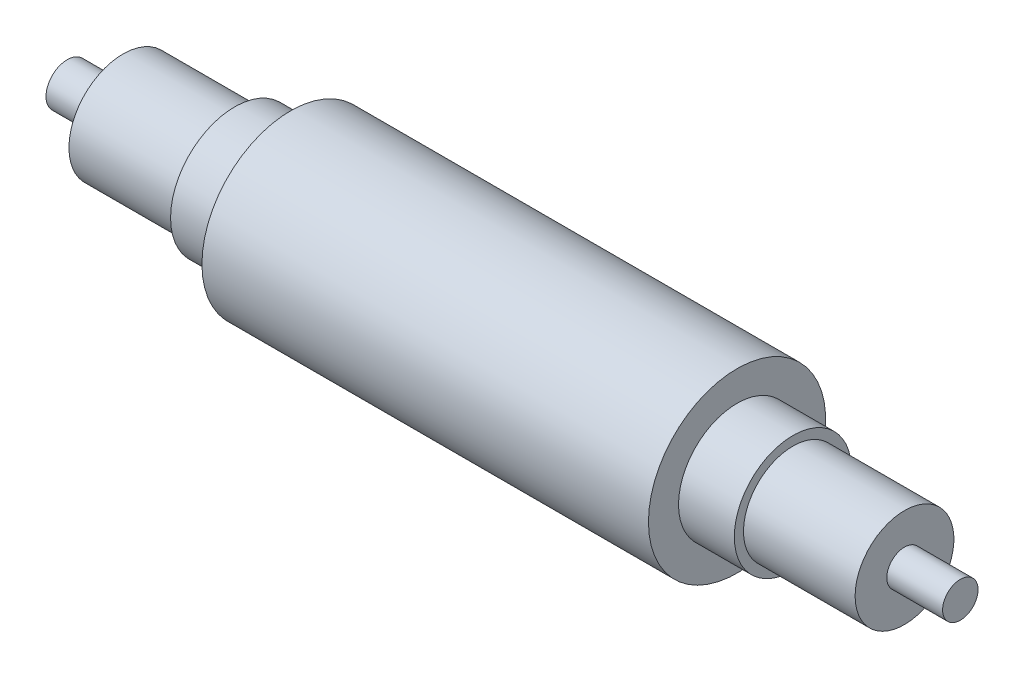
from build123d import *


with BuildPart() as part:
    # Sketch3 → Revolve1 (revolve)
    with BuildSketch(Plane.XY, mode=Mode.PRIVATE) as revolve1_sk:
        Polygon((175, -7.9375), (200, -7.9375), (200, 0), (-200, 0), (-200, -7.51), (-200, -9.525), (-175, -9.525), (-175, -24.245), (-125, -24.245), (-125, -28.73), (-100, -28.73), (-100, -39.6875), (0, -39.6875), (100, -39.6875), (100, -26.22), (125, -26.22), (125, -22.12), (175, -22.12), align=None)
    revolve(revolve1_sk.sketch.rotate(Axis((-273.675289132, 0, 0), (1, 0, 0)), 270), axis=Axis((-273.675289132, 0, 0), (1, 0, 0)))


solid = part.part
